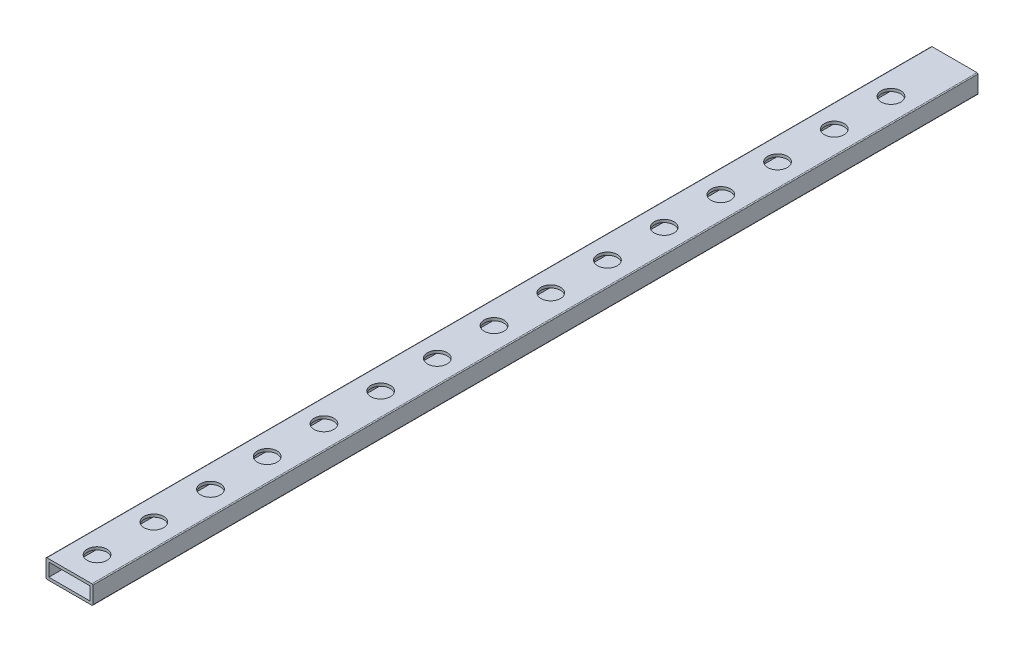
from build123d import *

# Parameters (mm, degrees)
ESQUISSE1_W             = 22
ESQUISSE1_H             = 7
BOSS_EXTRU_1_DEPTH      = 473
ESQUISSE2_R             = 5.25
ENL_V_MAT_EXTRU_1_DEPTH = 473


with BuildPart() as part:
    # Esquisse1 → Boss.-Extru.1 (new body)
    with BuildSketch(Plane.XY):
        with BuildLine():
            Line((-12, 5), (12, 5))
            ThreePointArc((12, 5), (12.353553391, 4.853553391), (12.5, 4.5))
            Line((12.5, 4.5), (12.5, -4.5))
            ThreePointArc((12.5, -4.5), (12.353553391, -4.853553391), (12, -5))
            Line((12, -5), (-12, -5))
            ThreePointArc((-12, -5), (-12.353553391, -4.853553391), (-12.5, -4.5))
            Line((-12.5, -4.5), (-12.5, 4.5))
            ThreePointArc((-12.5, 4.5), (-12.353553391, 4.853553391), (-12, 5))
        make_face()
        Rectangle(ESQUISSE1_W, ESQUISSE1_H, mode=Mode.SUBTRACT)
    extrude(amount=BOSS_EXTRU_1_DEPTH)

    # Esquisse2 → Enl_v. mat.-Extru.1 (cut)
    with BuildSketch(Plane(origin=(0, 5, 0), x_dir=(1, 0, 0), z_dir=(0, 1, 0))):
        with Locations(Location((0, -34, 0), (0, 0, 180))):
            Circle(ESQUISSE2_R)
        with Locations(Location((0, -64.3, 0), (0, 0, 180))):
            Circle(ESQUISSE2_R)
        with Locations(Location((0, -94.6, 0), (0, 0, 180))):
            Circle(ESQUISSE2_R)
        with Locations(Location((0, -124.9, 0), (0, 0, 180))):
            Circle(ESQUISSE2_R)
        with Locations(Location((0, -155.2, 0), (0, 0, 180))):
            Circle(ESQUISSE2_R)
        with Locations(Location((0, -185.5, 0), (0, 0, 180))):
            Circle(ESQUISSE2_R)
        with Locations(Location((0, -215.8, 0), (0, 0, 180))):
            Circle(ESQUISSE2_R)
        with Locations(Location((0, -246.1, 0), (0, 0, 180))):
            Circle(ESQUISSE2_R)
        with Locations(Location((0, -276.4, 0), (0, 0, 180))):
            Circle(ESQUISSE2_R)
        with Locations(Location((0, -306.7, 0), (0, 0, 180))):
            Circle(ESQUISSE2_R)
        with Locations(Location((0, -337, 0), (0, 0, 180))):
            Circle(ESQUISSE2_R)
        with Locations(Location((0, -367.3, 0), (0, 0, 180))):
            Circle(ESQUISSE2_R)
        with Locations(Location((0, -397.6, 0), (0, 0, 180))):
            Circle(ESQUISSE2_R)
        with Locations(Location((0, -427.9, 0), (0, 0, 180))):
            Circle(ESQUISSE2_R)
        with Locations(Location((0, -458.2, 0), (0, 0, 180))):
            Circle(ESQUISSE2_R)
    extrude(amount=-ENL_V_MAT_EXTRU_1_DEPTH, mode=Mode.SUBTRACT)


solid = part.part
